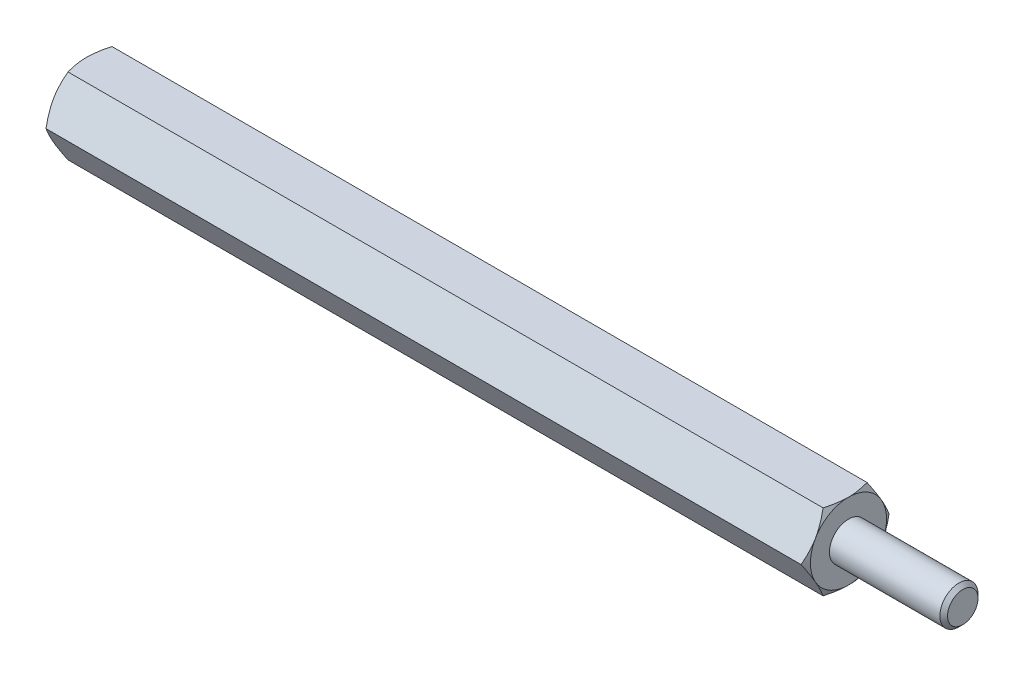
ISO-10303-21;
HEADER;
FILE_DESCRIPTION(('STEP AP214'),'2;1');
FILE_NAME('part.step','',(''),(''),'','','');
FILE_SCHEMA(('AUTOMOTIVE_DESIGN { 1 0 10303 214 1 1 1 1 }'));
ENDSEC;
DATA;
#1=APPLICATION_CONTEXT('core data for automotive mechanical design processes');
#2=APPLICATION_PROTOCOL_DEFINITION('international standard','automotive_design',2000,#1);
#3=PRODUCT_CONTEXT('',#1,'mechanical');
#4=PRODUCT('Part','Part','',(#3));
#5=PRODUCT_RELATED_PRODUCT_CATEGORY('part','',(#4));
#6=PRODUCT_DEFINITION_FORMATION('','',#4);
#7=PRODUCT_DEFINITION_CONTEXT('part definition',#1,'design');
#8=PRODUCT_DEFINITION('design','',#6,#7);
#9=PRODUCT_DEFINITION_SHAPE('','',#8);
#10=(LENGTH_UNIT() NAMED_UNIT(*) SI_UNIT(.MILLI.,.METRE.));
#11=(NAMED_UNIT(*) PLANE_ANGLE_UNIT() SI_UNIT($,.RADIAN.));
#12=(NAMED_UNIT(*) SI_UNIT($,.STERADIAN.) SOLID_ANGLE_UNIT());
#13=UNCERTAINTY_MEASURE_WITH_UNIT(LENGTH_MEASURE(1.E-05),#10,'distance_accuracy_value','');
#14=(GEOMETRIC_REPRESENTATION_CONTEXT(3) GLOBAL_UNCERTAINTY_ASSIGNED_CONTEXT((#13)) GLOBAL_UNIT_ASSIGNED_CONTEXT((#10,
#11,#12)) REPRESENTATION_CONTEXT('',''));
#15=CARTESIAN_POINT('',(0.,0.,0.));
#16=DIRECTION('',(0.,0.,1.));
#17=DIRECTION('',(1.,0.,0.));
#18=AXIS2_PLACEMENT_3D('',#15,#16,#17);
#19=CARTESIAN_POINT('',(20.,2.,-1.15470053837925));
#20=DIRECTION('',(1.,0.,0.));
#21=DIRECTION('',(0.,0.,-1.));
#22=AXIS2_PLACEMENT_3D('',#19,#20,#21);
#23=PLANE('',#22);
#24=CARTESIAN_POINT('',(20.,0.,0.));
#25=DIRECTION('',(1.,0.,0.));
#26=DIRECTION('',(0.,0.,-1.));
#27=AXIS2_PLACEMENT_3D('',#24,#25,#26);
#28=CIRCLE('',#27,2.);
#29=CARTESIAN_POINT('',(20.,-1.,-1.73205080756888));
#30=VERTEX_POINT('',#29);
#31=CARTESIAN_POINT('',(20.,0.999999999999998,-1.73205080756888));
#32=VERTEX_POINT('',#31);
#33=EDGE_CURVE('E288',#30,#32,#28,.T.);
#34=ORIENTED_EDGE('',*,*,#33,.T.);
#35=CARTESIAN_POINT('',(20.,2.,0.));
#36=VERTEX_POINT('',#35);
#37=EDGE_CURVE('E53',#32,#36,#28,.T.);
#38=ORIENTED_EDGE('',*,*,#37,.T.);
#39=CARTESIAN_POINT('',(20.,0.999999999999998,1.73205080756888));
#40=VERTEX_POINT('',#39);
#41=EDGE_CURVE('E296',#36,#40,#28,.T.);
#42=ORIENTED_EDGE('',*,*,#41,.T.);
#43=CARTESIAN_POINT('',(20.,-1.00000000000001,1.73205080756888));
#44=VERTEX_POINT('',#43);
#45=EDGE_CURVE('E301',#40,#44,#28,.T.);
#46=ORIENTED_EDGE('',*,*,#45,.T.);
#47=CARTESIAN_POINT('',(20.,0.,0.));
#48=DIRECTION('',(-1.,0.,0.));
#49=DIRECTION('',(0.,-1.,0.));
#50=AXIS2_PLACEMENT_3D('',#47,#48,#49);
#51=CIRCLE('',#50,2.);
#52=CARTESIAN_POINT('',(20.,-2.00000000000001,0.));
#53=VERTEX_POINT('',#52);
#54=EDGE_CURVE('E193',#53,#44,#51,.T.);
#55=ORIENTED_EDGE('',*,*,#54,.F.);
#56=EDGE_CURVE('E61',#53,#30,#28,.T.);
#57=ORIENTED_EDGE('',*,*,#56,.T.);
#58=EDGE_LOOP('',(#34,#38,#42,#46,#55,#57));
#59=FACE_BOUND('',#58,.T.);
#60=CARTESIAN_POINT('',(20.,0.,0.));
#61=DIRECTION('',(1.,0.,0.));
#62=DIRECTION('',(0.,0.,-1.));
#63=AXIS2_PLACEMENT_3D('',#60,#61,#62);
#64=CIRCLE('',#63,1.);
#65=CARTESIAN_POINT('',(20.,0.,-1.));
#66=VERTEX_POINT('',#65);
#67=EDGE_CURVE('E411',#66,#66,#64,.T.);
#68=ORIENTED_EDGE('',*,*,#67,.F.);
#69=EDGE_LOOP('',(#68));
#70=FACE_BOUND('',#69,.T.);
#71=ADVANCED_FACE('F37',(#59,#70),#23,.T.);
#72=CARTESIAN_POINT('',(20.,0.,-2.3094010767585));
#73=DIRECTION('',(0.,-0.5,0.866025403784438));
#74=DIRECTION('',(0.,-0.866025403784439,-0.5));
#75=AXIS2_PLACEMENT_3D('',#72,#73,#74);
#76=PLANE('',#75);
#77=CARTESIAN_POINT('',(19.8213005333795,-0.000199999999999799,-2.30951654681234));
#78=CARTESIAN_POINT('',(19.8506104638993,0.0876912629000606,-2.25877250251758));
#79=CARTESIAN_POINT('',(19.8772671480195,0.176341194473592,-2.20759044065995));
#80=CARTESIAN_POINT('',(19.9237975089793,0.355176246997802,-2.10433997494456));
#81=CARTESIAN_POINT('',(19.9436547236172,0.445364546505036,-2.05226973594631));
#82=CARTESIAN_POINT('',(19.9745665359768,0.624623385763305,-1.94877459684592));
#83=CARTESIAN_POINT('',(19.9858268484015,0.713666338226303,-1.89736562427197));
#84=CARTESIAN_POINT('',(19.9992713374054,0.892171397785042,-1.79430568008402));
#85=CARTESIAN_POINT('',(20.0014666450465,0.981632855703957,-1.74265508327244));
#86=CARTESIAN_POINT('',(19.9969090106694,1.1488083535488,-1.64613626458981));
#87=CARTESIAN_POINT('',(19.991275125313,1.22654737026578,-1.60125362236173));
#88=CARTESIAN_POINT('',(19.9734161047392,1.38151891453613,-1.51178075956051));
#89=CARTESIAN_POINT('',(19.9611848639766,1.4587509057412,-1.46719084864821));
#90=CARTESIAN_POINT('',(19.9306065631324,1.6140421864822,-1.37753338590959));
#91=CARTESIAN_POINT('',(19.9121298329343,1.69208181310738,-1.33247718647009));
#92=CARTESIAN_POINT('',(19.8701944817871,1.84699686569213,-1.24303693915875));
#93=CARTESIAN_POINT('',(19.8467457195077,1.92387427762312,-1.1986517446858));
#94=CARTESIAN_POINT('',(19.8213005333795,2.0002,-1.15458506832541));
#95=B_SPLINE_CURVE_WITH_KNOTS('',3,(#77,#78,#79,#80,#81,#82,#83,#84,#85,#86,#87,#88,#89,#90,#91,
#92,#93,#94),.UNSPECIFIED.,.F.,.F.,(4,2,2,2,2,2,2,2,4),(0.,0.317031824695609,0.634825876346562,
0.944753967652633,1.25430138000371,1.52387047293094,1.79368946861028,2.06949491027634,
2.34475850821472),.UNSPECIFIED.);
#96=CARTESIAN_POINT('',(19.8213672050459,0.,-2.3094010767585));
#97=VERTEX_POINT('',#96);
#98=EDGE_CURVE('E360',#97,#32,#95,.T.);
#99=ORIENTED_EDGE('',*,*,#98,.F.);
#100=DIRECTION('',(-1.,0.,0.));
#101=VECTOR('',#100,1.);
#102=CARTESIAN_POINT('',(20.,0.,-2.3094010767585));
#103=LINE('',#102,#101);
#104=CARTESIAN_POINT('',(-19.8213672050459,0.,-2.3094010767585));
#105=VERTEX_POINT('',#104);
#106=EDGE_CURVE('E264',#97,#105,#103,.T.);
#107=ORIENTED_EDGE('',*,*,#106,.T.);
#108=CARTESIAN_POINT('',(-19.8213005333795,2.0002,-1.15458506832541));
#109=CARTESIAN_POINT('',(-19.8506104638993,1.91230873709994,-1.20532911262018));
#110=CARTESIAN_POINT('',(-19.8772671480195,1.82365880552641,-1.2565111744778));
#111=CARTESIAN_POINT('',(-19.9237975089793,1.6448237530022,-1.35976164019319));
#112=CARTESIAN_POINT('',(-19.9436547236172,1.55463545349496,-1.41183187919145));
#113=CARTESIAN_POINT('',(-19.9745665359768,1.37537661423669,-1.51532701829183));
#114=CARTESIAN_POINT('',(-19.9858268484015,1.2863336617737,-1.56673599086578));
#115=CARTESIAN_POINT('',(-19.9992713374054,1.10782860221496,-1.66979593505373));
#116=CARTESIAN_POINT('',(-20.0014666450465,1.01836714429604,-1.72144653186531));
#117=CARTESIAN_POINT('',(-19.9969090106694,0.851191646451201,-1.81796535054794));
#118=CARTESIAN_POINT('',(-19.991275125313,0.773452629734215,-1.86284799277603));
#119=CARTESIAN_POINT('',(-19.9734161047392,0.618481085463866,-1.95232085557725));
#120=CARTESIAN_POINT('',(-19.9611848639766,0.541249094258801,-1.99691076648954));
#121=CARTESIAN_POINT('',(-19.9306065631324,0.385957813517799,-2.08656822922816));
#122=CARTESIAN_POINT('',(-19.9121298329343,0.30791818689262,-2.13162442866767));
#123=CARTESIAN_POINT('',(-19.8701944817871,0.153003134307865,-2.221064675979));
#124=CARTESIAN_POINT('',(-19.8467457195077,0.0761257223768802,-2.26544987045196));
#125=CARTESIAN_POINT('',(-19.8213005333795,-0.000199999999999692,-2.30951654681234));
#126=B_SPLINE_CURVE_WITH_KNOTS('',3,(#108,#109,#110,#111,#112,#113,#114,#115,#116,#117,#118,
#119,#120,#121,#122,#123,#124,#125),.UNSPECIFIED.,.F.,.F.,(4,2,2,2,2,2,2,2,4),(0.,
0.31703182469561,0.634825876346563,0.944753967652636,1.25430138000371,1.52387047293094,
1.79368946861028,2.06949491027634,2.34475850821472),.UNSPECIFIED.);
#127=CARTESIAN_POINT('',(-20.,0.999999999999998,-1.73205080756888));
#128=VERTEX_POINT('',#127);
#129=EDGE_CURVE('E328',#128,#105,#126,.T.);
#130=ORIENTED_EDGE('',*,*,#129,.F.);
#131=CARTESIAN_POINT('',(-19.8213672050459,2.,-1.15470053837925));
#132=VERTEX_POINT('',#131);
#133=EDGE_CURVE('E325',#132,#128,#126,.T.);
#134=ORIENTED_EDGE('',*,*,#133,.F.);
#135=DIRECTION('',(-1.,0.,0.));
#136=VECTOR('',#135,1.);
#137=CARTESIAN_POINT('',(20.,2.,-1.15470053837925));
#138=LINE('',#137,#136);
#139=CARTESIAN_POINT('',(19.821367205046,2.,-1.15470053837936));
#140=VERTEX_POINT('',#139);
#141=EDGE_CURVE('E279',#140,#132,#138,.T.);
#142=ORIENTED_EDGE('',*,*,#141,.F.);
#143=EDGE_CURVE('E229',#32,#140,#95,.T.);
#144=ORIENTED_EDGE('',*,*,#143,.F.);
#145=EDGE_LOOP('',(#99,#107,#130,#134,#142,#144));
#146=FACE_BOUND('',#145,.T.);
#147=ADVANCED_FACE('F148',(#146),#76,.F.);
#148=CARTESIAN_POINT('',(20.,2.,-1.15470053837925));
#149=DIRECTION('',(0.,-1.,0.));
#150=DIRECTION('',(0.,0.,-1.));
#151=AXIS2_PLACEMENT_3D('',#148,#149,#150);
#152=PLANE('',#151);
#153=CARTESIAN_POINT('',(19.0041453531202,2.,-3.14239762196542));
#154=CARTESIAN_POINT('',(19.0468568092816,2.,-3.05468337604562));
#155=CARTESIAN_POINT('',(19.0891703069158,2.,-2.96677207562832));
#156=CARTESIAN_POINT('',(19.1727783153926,2.,-2.79045070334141));
#157=CARTESIAN_POINT('',(19.2140726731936,2.,-2.70204055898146));
#158=CARTESIAN_POINT('',(19.2956183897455,2.,-2.52418069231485));
#159=CARTESIAN_POINT('',(19.3358631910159,2.,-2.43472795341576));
#160=CARTESIAN_POINT('',(19.4147590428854,2.,-2.25512498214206));
#161=CARTESIAN_POINT('',(19.4534101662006,2.,-2.16497478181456));
#162=CARTESIAN_POINT('',(19.5299661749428,2.,-1.98078525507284));
#163=CARTESIAN_POINT('',(19.5678021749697,2.,-1.88671714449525));
#164=CARTESIAN_POINT('',(19.6407004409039,2.,-1.69751412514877));
#165=CARTESIAN_POINT('',(19.6757629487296,2.,-1.60237931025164));
#166=CARTESIAN_POINT('',(19.7422353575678,2.,-1.41102905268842));
#167=CARTESIAN_POINT('',(19.7736519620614,2.,-1.31481596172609));
#168=CARTESIAN_POINT('',(19.8318476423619,2.,-1.12101028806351));
#169=CARTESIAN_POINT('',(19.8586281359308,2.,-1.02341813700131));
#170=CARTESIAN_POINT('',(19.9061516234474,2.,-0.827336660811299));
#171=CARTESIAN_POINT('',(19.9269281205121,2.,-0.728855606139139));
#172=CARTESIAN_POINT('',(19.9612955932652,2.,-0.530628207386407));
#173=CARTESIAN_POINT('',(19.9748873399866,2.,-0.430882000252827));
#174=CARTESIAN_POINT('',(19.9936215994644,2.,-0.231937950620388));
#175=CARTESIAN_POINT('',(19.998875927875,2.,-0.132750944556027));
#176=CARTESIAN_POINT('',(20.0007996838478,2.,0.0657049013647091));
#177=CARTESIAN_POINT('',(19.9974689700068,2.,0.164973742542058));
#178=CARTESIAN_POINT('',(19.9796512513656,2.,0.400692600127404));
#179=CARTESIAN_POINT('',(19.9613884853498,2.,0.536859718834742));
#180=CARTESIAN_POINT('',(19.9117995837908,2.,0.80679264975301));
#181=CARTESIAN_POINT('',(19.8804615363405,2.,0.940556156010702));
#182=CARTESIAN_POINT('',(19.8073369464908,2.,1.20849227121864));
#183=CARTESIAN_POINT('',(19.7653231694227,2.,1.34260127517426));
#184=CARTESIAN_POINT('',(19.6970115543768,2.,1.54188460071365));
#185=CARTESIAN_POINT('',(19.6733612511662,2.,1.6079939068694));
#186=CARTESIAN_POINT('',(19.6245731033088,2.,1.73966131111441));
#187=CARTESIAN_POINT('',(19.5994352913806,2.,1.80521942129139));
#188=CARTESIAN_POINT('',(19.530452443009,2.,1.98014362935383));
#189=CARTESIAN_POINT('',(19.4854828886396,2.,2.08906517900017));
#190=CARTESIAN_POINT('',(19.3929395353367,2.,2.3058004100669));
#191=CARTESIAN_POINT('',(19.345365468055,2.,2.41361397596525));
#192=CARTESIAN_POINT('',(19.2482262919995,2.,2.62838132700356));
#193=CARTESIAN_POINT('',(19.1986605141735,2.,2.73533480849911));
#194=CARTESIAN_POINT('',(19.0980014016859,2.,2.94852186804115));
#195=CARTESIAN_POINT('',(19.046908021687,2.,3.05475542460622));
#196=CARTESIAN_POINT('',(18.8916961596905,2.,3.37291303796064));
#197=CARTESIAN_POINT('',(18.7857965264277,2.,3.58396705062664));
#198=CARTESIAN_POINT('',(18.5710098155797,2.,4.00448363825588));
#199=CARTESIAN_POINT('',(18.4621233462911,2.,4.21394652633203));
#200=CARTESIAN_POINT('',(18.2537677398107,2.,4.61000648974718));
#201=CARTESIAN_POINT('',(18.1545007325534,2.,4.79671008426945));
#202=CARTESIAN_POINT('',(17.9547641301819,2.,5.16948614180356));
#203=CARTESIAN_POINT('',(17.8542944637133,2.,5.35555856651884));
#204=CARTESIAN_POINT('',(17.6527937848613,2.,5.72660635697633));
#205=CARTESIAN_POINT('',(17.5517657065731,2.,5.91158331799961));
#206=CARTESIAN_POINT('',(17.3490239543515,2.,6.28114276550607));
#207=CARTESIAN_POINT('',(17.2473103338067,2.,6.46572528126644));
#208=CARTESIAN_POINT('',(17.1453470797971,2.,6.65016883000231));
#209=B_SPLINE_CURVE_WITH_KNOTS('',3,(#153,#154,#155,#156,#157,#158,#159,#160,#161,#162,#163,
#164,#165,#166,#167,#168,#169,#170,#171,#172,#173,#174,#175,#176,#177,#178,#179,#180,#181,#182,
#183,#184,#185,#186,#187,#188,#189,#190,#191,#192,#193,#194,#195,#196,#197,#198,#199,#200,#201,
#202,#203,#204,#205,#206,#207,#208),.UNSPECIFIED.,.F.,.F.,(4,2,2,2,2,2,2,2,2,2,2,2,2,2,2,2,2,2,
2,2,2,2,2,2,2,2,2,4),(0.,0.292684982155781,0.585413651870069,0.879667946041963,1.17390879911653,
1.47805164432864,1.78216793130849,2.08571589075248,2.38917085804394,2.690898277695,
2.99259331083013,3.29020694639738,3.58782548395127,3.99913738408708,4.41082482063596,
4.83214112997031,5.04276628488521,5.25338680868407,5.60685637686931,5.96036243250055,
6.31398824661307,6.66762456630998,7.37597688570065,8.0841859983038,8.71853756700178,
9.35292696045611,9.98522933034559,10.6174830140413),.UNSPECIFIED.);
#210=EDGE_CURVE('E227',#140,#36,#209,.T.);
#211=ORIENTED_EDGE('',*,*,#210,.F.);
#212=ORIENTED_EDGE('',*,*,#141,.T.);
#213=CARTESIAN_POINT('',(-19.0041453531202,2.,-3.14239762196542));
#214=CARTESIAN_POINT('',(-19.0468568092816,2.,-3.05468337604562));
#215=CARTESIAN_POINT('',(-19.0891703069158,2.,-2.96677207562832));
#216=CARTESIAN_POINT('',(-19.1727783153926,2.,-2.79045070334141));
#217=CARTESIAN_POINT('',(-19.2140726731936,2.,-2.70204055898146));
#218=CARTESIAN_POINT('',(-19.2956183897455,2.,-2.52418069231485));
#219=CARTESIAN_POINT('',(-19.3358631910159,2.,-2.43472795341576));
#220=CARTESIAN_POINT('',(-19.4147590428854,2.,-2.25512498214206));
#221=CARTESIAN_POINT('',(-19.4534101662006,2.,-2.16497478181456));
#222=CARTESIAN_POINT('',(-19.5299661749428,2.,-1.98078525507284));
#223=CARTESIAN_POINT('',(-19.5678021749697,2.,-1.88671714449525));
#224=CARTESIAN_POINT('',(-19.6407004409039,2.,-1.69751412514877));
#225=CARTESIAN_POINT('',(-19.6757629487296,2.,-1.60237931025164));
#226=CARTESIAN_POINT('',(-19.7422353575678,2.,-1.41102905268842));
#227=CARTESIAN_POINT('',(-19.7736519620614,2.,-1.31481596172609));
#228=CARTESIAN_POINT('',(-19.8318476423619,2.,-1.12101028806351));
#229=CARTESIAN_POINT('',(-19.8586281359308,2.,-1.02341813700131));
#230=CARTESIAN_POINT('',(-19.9061516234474,2.,-0.827336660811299));
#231=CARTESIAN_POINT('',(-19.9269281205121,2.,-0.728855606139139));
#232=CARTESIAN_POINT('',(-19.9612955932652,2.,-0.530628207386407));
#233=CARTESIAN_POINT('',(-19.9748873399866,2.,-0.430882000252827));
#234=CARTESIAN_POINT('',(-19.9936215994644,2.,-0.231937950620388));
#235=CARTESIAN_POINT('',(-19.998875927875,2.,-0.132750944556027));
#236=CARTESIAN_POINT('',(-20.0007996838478,2.,0.0657049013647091));
#237=CARTESIAN_POINT('',(-19.9974689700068,2.,0.164973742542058));
#238=CARTESIAN_POINT('',(-19.9796512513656,2.,0.400692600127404));
#239=CARTESIAN_POINT('',(-19.9613884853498,2.,0.536859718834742));
#240=CARTESIAN_POINT('',(-19.9117995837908,2.,0.80679264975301));
#241=CARTESIAN_POINT('',(-19.8804615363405,2.,0.940556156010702));
#242=CARTESIAN_POINT('',(-19.8073369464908,2.,1.20849227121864));
#243=CARTESIAN_POINT('',(-19.7653231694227,2.,1.34260127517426));
#244=CARTESIAN_POINT('',(-19.6970115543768,2.,1.54188460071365));
#245=CARTESIAN_POINT('',(-19.6733612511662,2.,1.6079939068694));
#246=CARTESIAN_POINT('',(-19.6245731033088,2.,1.73966131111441));
#247=CARTESIAN_POINT('',(-19.5994352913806,2.,1.80521942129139));
#248=CARTESIAN_POINT('',(-19.530452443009,2.,1.98014362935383));
#249=CARTESIAN_POINT('',(-19.4854828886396,2.,2.08906517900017));
#250=CARTESIAN_POINT('',(-19.3929395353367,2.,2.3058004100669));
#251=CARTESIAN_POINT('',(-19.345365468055,2.,2.41361397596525));
#252=CARTESIAN_POINT('',(-19.2482262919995,2.,2.62838132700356));
#253=CARTESIAN_POINT('',(-19.1986605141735,2.,2.73533480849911));
#254=CARTESIAN_POINT('',(-19.0980014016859,2.,2.94852186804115));
#255=CARTESIAN_POINT('',(-19.046908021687,2.,3.05475542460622));
#256=CARTESIAN_POINT('',(-18.8916961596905,2.,3.37291303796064));
#257=CARTESIAN_POINT('',(-18.7857965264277,2.,3.58396705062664));
#258=CARTESIAN_POINT('',(-18.5710098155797,2.,4.00448363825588));
#259=CARTESIAN_POINT('',(-18.4621233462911,2.,4.21394652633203));
#260=CARTESIAN_POINT('',(-18.2537677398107,2.,4.61000648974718));
#261=CARTESIAN_POINT('',(-18.1545007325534,2.,4.79671008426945));
#262=CARTESIAN_POINT('',(-17.9547641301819,2.,5.16948614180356));
#263=CARTESIAN_POINT('',(-17.8542944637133,2.,5.35555856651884));
#264=CARTESIAN_POINT('',(-17.6527937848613,2.,5.72660635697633));
#265=CARTESIAN_POINT('',(-17.5517657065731,2.,5.91158331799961));
#266=CARTESIAN_POINT('',(-17.3490239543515,2.,6.28114276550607));
#267=CARTESIAN_POINT('',(-17.2473103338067,2.,6.46572528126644));
#268=CARTESIAN_POINT('',(-17.1453470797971,2.,6.65016883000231));
#269=B_SPLINE_CURVE_WITH_KNOTS('',3,(#213,#214,#215,#216,#217,#218,#219,#220,#221,#222,#223,
#224,#225,#226,#227,#228,#229,#230,#231,#232,#233,#234,#235,#236,#237,#238,#239,#240,#241,#242,
#243,#244,#245,#246,#247,#248,#249,#250,#251,#252,#253,#254,#255,#256,#257,#258,#259,#260,#261,
#262,#263,#264,#265,#266,#267,#268),.UNSPECIFIED.,.F.,.F.,(4,2,2,2,2,2,2,2,2,2,2,2,2,2,2,2,2,2,
2,2,2,2,2,2,2,2,2,4),(0.,0.292684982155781,0.585413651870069,0.879667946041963,1.17390879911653,
1.47805164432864,1.78216793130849,2.08571589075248,2.38917085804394,2.690898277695,
2.99259331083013,3.29020694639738,3.58782548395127,3.99913738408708,4.41082482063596,
4.83214112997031,5.04276628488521,5.25338680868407,5.60685637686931,5.96036243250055,
6.31398824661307,6.66762456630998,7.37597688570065,8.0841859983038,8.71853756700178,
9.35292696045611,9.98522933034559,10.6174830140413),.UNSPECIFIED.);
#270=CARTESIAN_POINT('',(-20.,2.,0.));
#271=VERTEX_POINT('',#270);
#272=EDGE_CURVE('E241',#271,#132,#269,.F.);
#273=ORIENTED_EDGE('',*,*,#272,.F.);
#274=CARTESIAN_POINT('',(-19.8213672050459,2.,1.15470053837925));
#275=VERTEX_POINT('',#274);
#276=EDGE_CURVE('E249',#275,#271,#269,.F.);
#277=ORIENTED_EDGE('',*,*,#276,.F.);
#278=DIRECTION('',(-1.,0.,0.));
#279=VECTOR('',#278,1.);
#280=CARTESIAN_POINT('',(20.,2.,1.15470053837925));
#281=LINE('',#280,#279);
#282=CARTESIAN_POINT('',(19.8213672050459,2.,1.15470053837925));
#283=VERTEX_POINT('',#282);
#284=EDGE_CURVE('E276',#283,#275,#281,.T.);
#285=ORIENTED_EDGE('',*,*,#284,.F.);
#286=EDGE_CURVE('E221',#36,#283,#209,.T.);
#287=ORIENTED_EDGE('',*,*,#286,.F.);
#288=EDGE_LOOP('',(#211,#212,#273,#277,#285,#287));
#289=FACE_BOUND('',#288,.T.);
#290=ADVANCED_FACE('F153',(#289),#152,.F.);
#291=CARTESIAN_POINT('',(20.,2.,1.15470053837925));
#292=DIRECTION('',(0.,-0.5,-0.866025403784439));
#293=DIRECTION('',(0.,0.866025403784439,-0.5));
#294=AXIS2_PLACEMENT_3D('',#291,#292,#293);
#295=PLANE('',#294);
#296=CARTESIAN_POINT('',(19.8213005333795,2.0002,1.15458506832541));
#297=CARTESIAN_POINT('',(19.8506104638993,1.91230873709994,1.20532911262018));
#298=CARTESIAN_POINT('',(19.8772671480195,1.82365880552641,1.2565111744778));
#299=CARTESIAN_POINT('',(19.9237975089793,1.6448237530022,1.35976164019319));
#300=CARTESIAN_POINT('',(19.9436547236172,1.55463545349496,1.41183187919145));
#301=CARTESIAN_POINT('',(19.9745665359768,1.37537661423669,1.51532701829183));
#302=CARTESIAN_POINT('',(19.9858268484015,1.2863336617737,1.56673599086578));
#303=CARTESIAN_POINT('',(19.9992713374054,1.10782860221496,1.66979593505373));
#304=CARTESIAN_POINT('',(20.0014666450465,1.01836714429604,1.72144653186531));
#305=CARTESIAN_POINT('',(19.9969090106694,0.851191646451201,1.81796535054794));
#306=CARTESIAN_POINT('',(19.991275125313,0.773452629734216,1.86284799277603));
#307=CARTESIAN_POINT('',(19.9734161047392,0.618481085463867,1.95232085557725));
#308=CARTESIAN_POINT('',(19.9611848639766,0.541249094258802,1.99691076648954));
#309=CARTESIAN_POINT('',(19.9306065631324,0.3859578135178,2.08656822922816));
#310=CARTESIAN_POINT('',(19.9121298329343,0.307918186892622,2.13162442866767));
#311=CARTESIAN_POINT('',(19.8701944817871,0.153003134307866,2.221064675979));
#312=CARTESIAN_POINT('',(19.8467457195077,0.0761257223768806,2.26544987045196));
#313=CARTESIAN_POINT('',(19.8213005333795,-0.000199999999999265,2.30951654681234));
#314=B_SPLINE_CURVE_WITH_KNOTS('',3,(#296,#297,#298,#299,#300,#301,#302,#303,#304,#305,#306,
#307,#308,#309,#310,#311,#312,#313),.UNSPECIFIED.,.F.,.F.,(4,2,2,2,2,2,2,2,4),(0.,
0.31703182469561,0.634825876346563,0.944753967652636,1.25430138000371,1.52387047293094,
1.79368946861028,2.06949491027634,2.34475850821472),.UNSPECIFIED.);
#315=EDGE_CURVE('E228',#283,#40,#314,.T.);
#316=ORIENTED_EDGE('',*,*,#315,.F.);
#317=ORIENTED_EDGE('',*,*,#284,.T.);
#318=CARTESIAN_POINT('',(-19.8213005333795,-0.000199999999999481,2.30951654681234));
#319=CARTESIAN_POINT('',(-19.8506104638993,0.0876912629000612,2.25877250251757));
#320=CARTESIAN_POINT('',(-19.8772671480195,0.176341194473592,2.20759044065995));
#321=CARTESIAN_POINT('',(-19.9237975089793,0.355176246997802,2.10433997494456));
#322=CARTESIAN_POINT('',(-19.9436547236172,0.445364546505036,2.0522697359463));
#323=CARTESIAN_POINT('',(-19.9745665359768,0.624623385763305,1.94877459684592));
#324=CARTESIAN_POINT('',(-19.9858268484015,0.713666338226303,1.89736562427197));
#325=CARTESIAN_POINT('',(-19.9992713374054,0.892171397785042,1.79430568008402));
#326=CARTESIAN_POINT('',(-20.0014666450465,0.981632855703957,1.74265508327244));
#327=CARTESIAN_POINT('',(-19.9969090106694,1.1488083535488,1.64613626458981));
#328=CARTESIAN_POINT('',(-19.991275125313,1.22654737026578,1.60125362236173));
#329=CARTESIAN_POINT('',(-19.9734161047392,1.38151891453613,1.51178075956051));
#330=CARTESIAN_POINT('',(-19.9611848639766,1.4587509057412,1.46719084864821));
#331=CARTESIAN_POINT('',(-19.9306065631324,1.6140421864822,1.37753338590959));
#332=CARTESIAN_POINT('',(-19.9121298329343,1.69208181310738,1.33247718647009));
#333=CARTESIAN_POINT('',(-19.8701944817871,1.84699686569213,1.24303693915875));
#334=CARTESIAN_POINT('',(-19.8467457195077,1.92387427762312,1.1986517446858));
#335=CARTESIAN_POINT('',(-19.8213005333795,2.0002,1.15458506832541));
#336=B_SPLINE_CURVE_WITH_KNOTS('',3,(#318,#319,#320,#321,#322,#323,#324,#325,#326,#327,#328,
#329,#330,#331,#332,#333,#334,#335),.UNSPECIFIED.,.F.,.F.,(4,2,2,2,2,2,2,2,4),(0.,
0.31703182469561,0.634825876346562,0.944753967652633,1.25430138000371,1.52387047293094,
1.79368946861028,2.06949491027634,2.34475850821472),.UNSPECIFIED.);
#337=CARTESIAN_POINT('',(-20.,0.999999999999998,1.73205080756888));
#338=VERTEX_POINT('',#337);
#339=EDGE_CURVE('E255',#338,#275,#336,.T.);
#340=ORIENTED_EDGE('',*,*,#339,.F.);
#341=CARTESIAN_POINT('',(-19.8213672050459,0.,2.3094010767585));
#342=VERTEX_POINT('',#341);
#343=EDGE_CURVE('E262',#342,#338,#336,.T.);
#344=ORIENTED_EDGE('',*,*,#343,.F.);
#345=DIRECTION('',(-1.,0.,0.));
#346=VECTOR('',#345,1.);
#347=CARTESIAN_POINT('',(20.,0.,2.3094010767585));
#348=LINE('',#347,#346);
#349=CARTESIAN_POINT('',(19.8213672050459,0.,2.3094010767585));
#350=VERTEX_POINT('',#349);
#351=EDGE_CURVE('E273',#350,#342,#348,.T.);
#352=ORIENTED_EDGE('',*,*,#351,.F.);
#353=EDGE_CURVE('E215',#40,#350,#314,.T.);
#354=ORIENTED_EDGE('',*,*,#353,.F.);
#355=EDGE_LOOP('',(#316,#317,#340,#344,#352,#354));
#356=FACE_BOUND('',#355,.T.);
#357=ADVANCED_FACE('F235',(#356),#295,.F.);
#358=CARTESIAN_POINT('',(20.,0.,2.3094010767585));
#359=DIRECTION('',(0.,0.5,-0.866025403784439));
#360=DIRECTION('',(0.,0.866025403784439,0.5));
#361=AXIS2_PLACEMENT_3D('',#358,#359,#360);
#362=PLANE('',#361);
#363=CARTESIAN_POINT('',(19.8213005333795,0.000200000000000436,2.30951654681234));
#364=CARTESIAN_POINT('',(19.8506104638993,-0.0876912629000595,2.25877250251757));
#365=CARTESIAN_POINT('',(19.8772671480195,-0.176341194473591,2.20759044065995));
#366=CARTESIAN_POINT('',(19.9237975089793,-0.355176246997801,2.10433997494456));
#367=CARTESIAN_POINT('',(19.9436547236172,-0.445364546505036,2.0522697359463));
#368=CARTESIAN_POINT('',(19.9745665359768,-0.624623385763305,1.94877459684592));
#369=CARTESIAN_POINT('',(19.9858268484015,-0.713666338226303,1.89736562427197));
#370=CARTESIAN_POINT('',(19.9992713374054,-0.892171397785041,1.79430568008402));
#371=CARTESIAN_POINT('',(20.0014666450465,-0.981632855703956,1.74265508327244));
#372=CARTESIAN_POINT('',(19.9969090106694,-1.1488083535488,1.64613626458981));
#373=CARTESIAN_POINT('',(19.991275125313,-1.22654737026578,1.60125362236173));
#374=CARTESIAN_POINT('',(19.9734161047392,-1.38151891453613,1.51178075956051));
#375=CARTESIAN_POINT('',(19.9611848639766,-1.4587509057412,1.46719084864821));
#376=CARTESIAN_POINT('',(19.9306065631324,-1.6140421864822,1.37753338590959));
#377=CARTESIAN_POINT('',(19.9121298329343,-1.69208181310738,1.33247718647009));
#378=CARTESIAN_POINT('',(19.8701944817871,-1.84699686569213,1.24303693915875));
#379=CARTESIAN_POINT('',(19.8467457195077,-1.92387427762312,1.1986517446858));
#380=CARTESIAN_POINT('',(19.8213005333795,-2.0002,1.15458506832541));
#381=B_SPLINE_CURVE_WITH_KNOTS('',3,(#363,#364,#365,#366,#367,#368,#369,#370,#371,#372,#373,
#374,#375,#376,#377,#378,#379,#380),.UNSPECIFIED.,.F.,.F.,(4,2,2,2,2,2,2,2,4),(0.,
0.317031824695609,0.634825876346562,0.944753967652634,1.25430138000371,1.52387047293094,
1.79368946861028,2.06949491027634,2.34475850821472),.UNSPECIFIED.);
#382=EDGE_CURVE('E389',#350,#44,#381,.T.);
#383=ORIENTED_EDGE('',*,*,#382,.F.);
#384=ORIENTED_EDGE('',*,*,#351,.T.);
#385=CARTESIAN_POINT('',(-19.8213005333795,-2.0002,1.15458506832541));
#386=CARTESIAN_POINT('',(-19.8506104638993,-1.91230873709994,1.20532911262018));
#387=CARTESIAN_POINT('',(-19.8772671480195,-1.82365880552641,1.2565111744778));
#388=CARTESIAN_POINT('',(-19.9237975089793,-1.6448237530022,1.35976164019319));
#389=CARTESIAN_POINT('',(-19.9436547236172,-1.55463545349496,1.41183187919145));
#390=CARTESIAN_POINT('',(-19.9745665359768,-1.3753766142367,1.51532701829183));
#391=CARTESIAN_POINT('',(-19.9858268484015,-1.2863336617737,1.56673599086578));
#392=CARTESIAN_POINT('',(-19.9992713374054,-1.10782860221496,1.66979593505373));
#393=CARTESIAN_POINT('',(-20.0014666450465,-1.01836714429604,1.72144653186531));
#394=CARTESIAN_POINT('',(-19.9969090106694,-0.851191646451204,1.81796535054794));
#395=CARTESIAN_POINT('',(-19.991275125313,-0.773452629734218,1.86284799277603));
#396=CARTESIAN_POINT('',(-19.9734161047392,-0.618481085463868,1.95232085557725));
#397=CARTESIAN_POINT('',(-19.9611848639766,-0.541249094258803,1.99691076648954));
#398=CARTESIAN_POINT('',(-19.9306065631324,-0.3859578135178,2.08656822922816));
#399=CARTESIAN_POINT('',(-19.9121298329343,-0.307918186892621,2.13162442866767));
#400=CARTESIAN_POINT('',(-19.8701944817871,-0.153003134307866,2.221064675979));
#401=CARTESIAN_POINT('',(-19.8467457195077,-0.07612572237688,2.26544987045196));
#402=CARTESIAN_POINT('',(-19.8213005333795,0.000200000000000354,2.30951654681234));
#403=B_SPLINE_CURVE_WITH_KNOTS('',3,(#385,#386,#387,#388,#389,#390,#391,#392,#393,#394,#395,
#396,#397,#398,#399,#400,#401,#402),.UNSPECIFIED.,.F.,.F.,(4,2,2,2,2,2,2,2,4),(0.,
0.317031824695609,0.634825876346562,0.944753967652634,1.25430138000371,1.52387047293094,
1.79368946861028,2.06949491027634,2.34475850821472),.UNSPECIFIED.);
#404=CARTESIAN_POINT('',(-20.,-1.00000000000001,1.73205080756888));
#405=VERTEX_POINT('',#404);
#406=EDGE_CURVE('E263',#405,#342,#403,.T.);
#407=ORIENTED_EDGE('',*,*,#406,.F.);
#408=CARTESIAN_POINT('',(-19.8213672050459,-2.,1.15470053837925));
#409=VERTEX_POINT('',#408);
#410=EDGE_CURVE('E250',#409,#405,#403,.T.);
#411=ORIENTED_EDGE('',*,*,#410,.F.);
#412=DIRECTION('',(-1.,0.,0.));
#413=VECTOR('',#412,1.);
#414=CARTESIAN_POINT('',(20.,-2.,1.15470053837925));
#415=LINE('',#414,#413);
#416=CARTESIAN_POINT('',(19.8213672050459,-2.,1.15470053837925));
#417=VERTEX_POINT('',#416);
#418=EDGE_CURVE('E270',#417,#409,#415,.T.);
#419=ORIENTED_EDGE('',*,*,#418,.F.);
#420=EDGE_CURVE('E210',#44,#417,#381,.T.);
#421=ORIENTED_EDGE('',*,*,#420,.F.);
#422=EDGE_LOOP('',(#383,#384,#407,#411,#419,#421));
#423=FACE_BOUND('',#422,.T.);
#424=ADVANCED_FACE('F364',(#423),#362,.F.);
#425=CARTESIAN_POINT('',(20.,-2.,1.15470053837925));
#426=DIRECTION('',(0.,1.,0.));
#427=DIRECTION('',(0.,0.,1.));
#428=AXIS2_PLACEMENT_3D('',#425,#426,#427);
#429=PLANE('',#428);
#430=CARTESIAN_POINT('',(19.0041453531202,-2.,-3.14239762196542));
#431=CARTESIAN_POINT('',(19.0468568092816,-2.,-3.05468337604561));
#432=CARTESIAN_POINT('',(19.0891703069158,-2.,-2.96677207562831));
#433=CARTESIAN_POINT('',(19.1727783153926,-2.,-2.79045070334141));
#434=CARTESIAN_POINT('',(19.2140726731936,-2.,-2.70204055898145));
#435=CARTESIAN_POINT('',(19.2956183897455,-2.,-2.52418069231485));
#436=CARTESIAN_POINT('',(19.3358631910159,-2.,-2.43472795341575));
#437=CARTESIAN_POINT('',(19.4147590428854,-2.,-2.25512498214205));
#438=CARTESIAN_POINT('',(19.4534101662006,-2.,-2.16497478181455));
#439=CARTESIAN_POINT('',(19.5299661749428,-2.,-1.98078525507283));
#440=CARTESIAN_POINT('',(19.5678021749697,-2.,-1.88671714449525));
#441=CARTESIAN_POINT('',(19.6407004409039,-2.,-1.69751412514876));
#442=CARTESIAN_POINT('',(19.6757629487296,-2.,-1.60237931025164));
#443=CARTESIAN_POINT('',(19.7422353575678,-2.,-1.41102905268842));
#444=CARTESIAN_POINT('',(19.7736519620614,-2.,-1.31481596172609));
#445=CARTESIAN_POINT('',(19.8318476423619,-2.,-1.12101028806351));
#446=CARTESIAN_POINT('',(19.8586281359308,-2.,-1.02341813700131));
#447=CARTESIAN_POINT('',(19.9061516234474,-2.,-0.8273366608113));
#448=CARTESIAN_POINT('',(19.9269281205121,-2.,-0.72885560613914));
#449=CARTESIAN_POINT('',(19.9612955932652,-2.,-0.530628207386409));
#450=CARTESIAN_POINT('',(19.9748873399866,-2.,-0.43088200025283));
#451=CARTESIAN_POINT('',(19.9936215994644,-2.,-0.231937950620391));
#452=CARTESIAN_POINT('',(19.998875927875,-2.,-0.132750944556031));
#453=CARTESIAN_POINT('',(20.0007996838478,-2.,0.0657049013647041));
#454=CARTESIAN_POINT('',(19.9974689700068,-2.,0.164973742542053));
#455=CARTESIAN_POINT('',(19.9796512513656,-2.,0.400692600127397));
#456=CARTESIAN_POINT('',(19.9613884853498,-2.,0.536859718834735));
#457=CARTESIAN_POINT('',(19.9117995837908,-2.,0.806792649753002));
#458=CARTESIAN_POINT('',(19.8804615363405,-2.,0.940556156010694));
#459=CARTESIAN_POINT('',(19.8073369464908,-2.,1.20849227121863));
#460=CARTESIAN_POINT('',(19.7653231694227,-2.,1.34260127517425));
#461=CARTESIAN_POINT('',(19.6970115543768,-2.,1.54188460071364));
#462=CARTESIAN_POINT('',(19.6733612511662,-2.,1.60799390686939));
#463=CARTESIAN_POINT('',(19.6245731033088,-2.,1.7396613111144));
#464=CARTESIAN_POINT('',(19.5994352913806,-2.,1.80521942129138));
#465=CARTESIAN_POINT('',(19.530452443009,-2.,1.98014362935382));
#466=CARTESIAN_POINT('',(19.4854828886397,-2.,2.08906517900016));
#467=CARTESIAN_POINT('',(19.3929395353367,-2.,2.30580041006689));
#468=CARTESIAN_POINT('',(19.345365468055,-2.,2.41361397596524));
#469=CARTESIAN_POINT('',(19.2482262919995,-2.,2.62838132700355));
#470=CARTESIAN_POINT('',(19.1986605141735,-2.,2.73533480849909));
#471=CARTESIAN_POINT('',(19.0980014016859,-2.,2.94852186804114));
#472=CARTESIAN_POINT('',(19.046908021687,-2.,3.0547554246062));
#473=CARTESIAN_POINT('',(18.8916961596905,-2.,3.37291303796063));
#474=CARTESIAN_POINT('',(18.7857965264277,-2.,3.58396705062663));
#475=CARTESIAN_POINT('',(18.5710098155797,-2.,4.00448363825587));
#476=CARTESIAN_POINT('',(18.4621233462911,-2.,4.21394652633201));
#477=CARTESIAN_POINT('',(18.2537677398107,-2.,4.61000648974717));
#478=CARTESIAN_POINT('',(18.1545007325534,-2.,4.79671008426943));
#479=CARTESIAN_POINT('',(17.9547641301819,-2.,5.16948614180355));
#480=CARTESIAN_POINT('',(17.8542944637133,-2.,5.35555856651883));
#481=CARTESIAN_POINT('',(17.6527937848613,-2.,5.72660635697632));
#482=CARTESIAN_POINT('',(17.5517657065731,-2.,5.91158331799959));
#483=CARTESIAN_POINT('',(17.3490239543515,-2.,6.28114276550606));
#484=CARTESIAN_POINT('',(17.2473103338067,-2.,6.46572528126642));
#485=CARTESIAN_POINT('',(17.1453470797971,-2.,6.6501688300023));
#486=B_SPLINE_CURVE_WITH_KNOTS('',3,(#430,#431,#432,#433,#434,#435,#436,#437,#438,#439,#440,
#441,#442,#443,#444,#445,#446,#447,#448,#449,#450,#451,#452,#453,#454,#455,#456,#457,#458,#459,
#460,#461,#462,#463,#464,#465,#466,#467,#468,#469,#470,#471,#472,#473,#474,#475,#476,#477,#478,
#479,#480,#481,#482,#483,#484,#485),.UNSPECIFIED.,.F.,.F.,(4,2,2,2,2,2,2,2,2,2,2,2,2,2,2,2,2,2,
2,2,2,2,2,2,2,2,2,4),(0.,0.292684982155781,0.585413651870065,0.879667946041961,1.17390879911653,
1.47805164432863,1.78216793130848,2.08571589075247,2.38917085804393,2.69089827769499,
2.99259331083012,3.29020694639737,3.58782548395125,3.99913738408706,4.41082482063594,
4.83214112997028,5.04276628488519,5.25338680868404,5.60685637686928,5.96036243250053,
6.31398824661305,6.66762456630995,7.37597688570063,8.08418599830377,8.71853756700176,
9.35292696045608,9.98522933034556,10.6174830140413),.UNSPECIFIED.);
#487=EDGE_CURVE('E314',#417,#53,#486,.F.);
#488=ORIENTED_EDGE('',*,*,#487,.F.);
#489=ORIENTED_EDGE('',*,*,#418,.T.);
#490=CARTESIAN_POINT('',(-19.0041453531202,-2.,-3.14239762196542));
#491=CARTESIAN_POINT('',(-19.0468568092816,-2.,-3.05468337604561));
#492=CARTESIAN_POINT('',(-19.0891703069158,-2.,-2.96677207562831));
#493=CARTESIAN_POINT('',(-19.1727783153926,-2.,-2.79045070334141));
#494=CARTESIAN_POINT('',(-19.2140726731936,-2.,-2.70204055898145));
#495=CARTESIAN_POINT('',(-19.2956183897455,-2.,-2.52418069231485));
#496=CARTESIAN_POINT('',(-19.3358631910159,-2.,-2.43472795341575));
#497=CARTESIAN_POINT('',(-19.4147590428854,-2.,-2.25512498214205));
#498=CARTESIAN_POINT('',(-19.4534101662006,-2.,-2.16497478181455));
#499=CARTESIAN_POINT('',(-19.5299661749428,-2.,-1.98078525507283));
#500=CARTESIAN_POINT('',(-19.5678021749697,-2.,-1.88671714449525));
#501=CARTESIAN_POINT('',(-19.6407004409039,-2.,-1.69751412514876));
#502=CARTESIAN_POINT('',(-19.6757629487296,-2.,-1.60237931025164));
#503=CARTESIAN_POINT('',(-19.7422353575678,-2.,-1.41102905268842));
#504=CARTESIAN_POINT('',(-19.7736519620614,-2.,-1.31481596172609));
#505=CARTESIAN_POINT('',(-19.8318476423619,-2.,-1.12101028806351));
#506=CARTESIAN_POINT('',(-19.8586281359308,-2.,-1.02341813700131));
#507=CARTESIAN_POINT('',(-19.9061516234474,-2.,-0.8273366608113));
#508=CARTESIAN_POINT('',(-19.9269281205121,-2.,-0.72885560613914));
#509=CARTESIAN_POINT('',(-19.9612955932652,-2.,-0.530628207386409));
#510=CARTESIAN_POINT('',(-19.9748873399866,-2.,-0.43088200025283));
#511=CARTESIAN_POINT('',(-19.9936215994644,-2.,-0.231937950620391));
#512=CARTESIAN_POINT('',(-19.998875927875,-2.,-0.132750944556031));
#513=CARTESIAN_POINT('',(-20.0007996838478,-2.,0.0657049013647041));
#514=CARTESIAN_POINT('',(-19.9974689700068,-2.,0.164973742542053));
#515=CARTESIAN_POINT('',(-19.9796512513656,-2.,0.400692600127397));
#516=CARTESIAN_POINT('',(-19.9613884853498,-2.,0.536859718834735));
#517=CARTESIAN_POINT('',(-19.9117995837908,-2.,0.806792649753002));
#518=CARTESIAN_POINT('',(-19.8804615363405,-2.,0.940556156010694));
#519=CARTESIAN_POINT('',(-19.8073369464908,-2.,1.20849227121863));
#520=CARTESIAN_POINT('',(-19.7653231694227,-2.,1.34260127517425));
#521=CARTESIAN_POINT('',(-19.6970115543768,-2.,1.54188460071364));
#522=CARTESIAN_POINT('',(-19.6733612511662,-2.,1.60799390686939));
#523=CARTESIAN_POINT('',(-19.6245731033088,-2.,1.7396613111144));
#524=CARTESIAN_POINT('',(-19.5994352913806,-2.,1.80521942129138));
#525=CARTESIAN_POINT('',(-19.530452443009,-2.,1.98014362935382));
#526=CARTESIAN_POINT('',(-19.4854828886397,-2.,2.08906517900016));
#527=CARTESIAN_POINT('',(-19.3929395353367,-2.,2.30580041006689));
#528=CARTESIAN_POINT('',(-19.345365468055,-2.,2.41361397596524));
#529=CARTESIAN_POINT('',(-19.2482262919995,-2.,2.62838132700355));
#530=CARTESIAN_POINT('',(-19.1986605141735,-2.,2.73533480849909));
#531=CARTESIAN_POINT('',(-19.0980014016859,-2.,2.94852186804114));
#532=CARTESIAN_POINT('',(-19.046908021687,-2.,3.0547554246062));
#533=CARTESIAN_POINT('',(-18.8916961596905,-2.,3.37291303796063));
#534=CARTESIAN_POINT('',(-18.7857965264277,-2.,3.58396705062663));
#535=CARTESIAN_POINT('',(-18.5710098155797,-2.,4.00448363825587));
#536=CARTESIAN_POINT('',(-18.4621233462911,-2.,4.21394652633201));
#537=CARTESIAN_POINT('',(-18.2537677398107,-2.,4.61000648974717));
#538=CARTESIAN_POINT('',(-18.1545007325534,-2.,4.79671008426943));
#539=CARTESIAN_POINT('',(-17.9547641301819,-2.,5.16948614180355));
#540=CARTESIAN_POINT('',(-17.8542944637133,-2.,5.35555856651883));
#541=CARTESIAN_POINT('',(-17.6527937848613,-2.,5.72660635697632));
#542=CARTESIAN_POINT('',(-17.5517657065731,-2.,5.91158331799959));
#543=CARTESIAN_POINT('',(-17.3490239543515,-2.,6.28114276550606));
#544=CARTESIAN_POINT('',(-17.2473103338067,-2.,6.46572528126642));
#545=CARTESIAN_POINT('',(-17.1453470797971,-2.,6.6501688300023));
#546=B_SPLINE_CURVE_WITH_KNOTS('',3,(#490,#491,#492,#493,#494,#495,#496,#497,#498,#499,#500,
#501,#502,#503,#504,#505,#506,#507,#508,#509,#510,#511,#512,#513,#514,#515,#516,#517,#518,#519,
#520,#521,#522,#523,#524,#525,#526,#527,#528,#529,#530,#531,#532,#533,#534,#535,#536,#537,#538,
#539,#540,#541,#542,#543,#544,#545),.UNSPECIFIED.,.F.,.F.,(4,2,2,2,2,2,2,2,2,2,2,2,2,2,2,2,2,2,
2,2,2,2,2,2,2,2,2,4),(0.,0.292684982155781,0.585413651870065,0.879667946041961,1.17390879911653,
1.47805164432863,1.78216793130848,2.08571589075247,2.38917085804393,2.69089827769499,
2.99259331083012,3.29020694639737,3.58782548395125,3.99913738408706,4.41082482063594,
4.83214112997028,5.04276628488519,5.25338680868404,5.60685637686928,5.96036243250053,
6.31398824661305,6.66762456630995,7.37597688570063,8.08418599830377,8.71853756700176,
9.35292696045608,9.98522933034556,10.6174830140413),.UNSPECIFIED.);
#547=CARTESIAN_POINT('',(-20.,-2.00000000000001,0.));
#548=VERTEX_POINT('',#547);
#549=EDGE_CURVE('E327',#548,#409,#546,.T.);
#550=ORIENTED_EDGE('',*,*,#549,.F.);
#551=CARTESIAN_POINT('',(-19.8213672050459,-2.,-1.15470053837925));
#552=VERTEX_POINT('',#551);
#553=EDGE_CURVE('E339',#552,#548,#546,.T.);
#554=ORIENTED_EDGE('',*,*,#553,.F.);
#555=DIRECTION('',(-1.,0.,0.));
#556=VECTOR('',#555,1.);
#557=CARTESIAN_POINT('',(20.,-2.,-1.15470053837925));
#558=LINE('',#557,#556);
#559=CARTESIAN_POINT('',(19.8213672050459,-2.,-1.15470053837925));
#560=VERTEX_POINT('',#559);
#561=EDGE_CURVE('E267',#560,#552,#558,.T.);
#562=ORIENTED_EDGE('',*,*,#561,.F.);
#563=EDGE_CURVE('E195',#53,#560,#486,.F.);
#564=ORIENTED_EDGE('',*,*,#563,.F.);
#565=EDGE_LOOP('',(#488,#489,#550,#554,#562,#564));
#566=FACE_BOUND('',#565,.T.);
#567=ADVANCED_FACE('F172',(#566),#429,.F.);
#568=CARTESIAN_POINT('',(20.,-2.,-1.15470053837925));
#569=DIRECTION('',(0.,0.5,0.866025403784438));
#570=DIRECTION('',(0.,-0.866025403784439,0.5));
#571=AXIS2_PLACEMENT_3D('',#568,#569,#570);
#572=PLANE('',#571);
#573=CARTESIAN_POINT('',(19.8213005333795,-2.0002,-1.15458506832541));
#574=CARTESIAN_POINT('',(19.8506104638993,-1.91230873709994,-1.20532911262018));
#575=CARTESIAN_POINT('',(19.8772671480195,-1.82365880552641,-1.2565111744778));
#576=CARTESIAN_POINT('',(19.9237975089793,-1.6448237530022,-1.35976164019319));
#577=CARTESIAN_POINT('',(19.9436547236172,-1.55463545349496,-1.41183187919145));
#578=CARTESIAN_POINT('',(19.9745665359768,-1.3753766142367,-1.51532701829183));
#579=CARTESIAN_POINT('',(19.9858268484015,-1.2863336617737,-1.56673599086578));
#580=CARTESIAN_POINT('',(19.9992713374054,-1.10782860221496,-1.66979593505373));
#581=CARTESIAN_POINT('',(20.0014666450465,-1.01836714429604,-1.72144653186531));
#582=CARTESIAN_POINT('',(19.9969090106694,-0.851191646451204,-1.81796535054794));
#583=CARTESIAN_POINT('',(19.991275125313,-0.773452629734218,-1.86284799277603));
#584=CARTESIAN_POINT('',(19.9734161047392,-0.618481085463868,-1.95232085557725));
#585=CARTESIAN_POINT('',(19.9611848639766,-0.541249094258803,-1.99691076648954));
#586=CARTESIAN_POINT('',(19.9306065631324,-0.3859578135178,-2.08656822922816));
#587=CARTESIAN_POINT('',(19.9121298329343,-0.307918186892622,-2.13162442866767));
#588=CARTESIAN_POINT('',(19.8701944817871,-0.153003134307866,-2.221064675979));
#589=CARTESIAN_POINT('',(19.8467457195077,-0.0761257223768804,-2.26544987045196));
#590=CARTESIAN_POINT('',(19.8213005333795,0.000199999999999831,-2.30951654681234));
#591=B_SPLINE_CURVE_WITH_KNOTS('',3,(#573,#574,#575,#576,#577,#578,#579,#580,#581,#582,#583,
#584,#585,#586,#587,#588,#589,#590),.UNSPECIFIED.,.F.,.F.,(4,2,2,2,2,2,2,2,4),(0.,
0.31703182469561,0.634825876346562,0.944753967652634,1.25430138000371,1.52387047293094,
1.79368946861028,2.06949491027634,2.34475850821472),.UNSPECIFIED.);
#592=EDGE_CURVE('E192',#560,#30,#591,.T.);
#593=ORIENTED_EDGE('',*,*,#592,.F.);
#594=ORIENTED_EDGE('',*,*,#561,.T.);
#595=CARTESIAN_POINT('',(-19.8213005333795,0.000199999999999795,-2.30951654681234));
#596=CARTESIAN_POINT('',(-19.8506104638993,-0.0876912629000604,-2.25877250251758));
#597=CARTESIAN_POINT('',(-19.8772671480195,-0.176341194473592,-2.20759044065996));
#598=CARTESIAN_POINT('',(-19.9237975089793,-0.355176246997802,-2.10433997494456));
#599=CARTESIAN_POINT('',(-19.9436547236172,-0.445364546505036,-2.05226973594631));
#600=CARTESIAN_POINT('',(-19.9745665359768,-0.624623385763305,-1.94877459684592));
#601=CARTESIAN_POINT('',(-19.9858268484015,-0.713666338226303,-1.89736562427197));
#602=CARTESIAN_POINT('',(-19.9992713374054,-0.892171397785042,-1.79430568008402));
#603=CARTESIAN_POINT('',(-20.0014666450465,-0.981632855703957,-1.74265508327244));
#604=CARTESIAN_POINT('',(-19.9969090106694,-1.1488083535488,-1.64613626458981));
#605=CARTESIAN_POINT('',(-19.991275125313,-1.22654737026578,-1.60125362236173));
#606=CARTESIAN_POINT('',(-19.9734161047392,-1.38151891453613,-1.51178075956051));
#607=CARTESIAN_POINT('',(-19.9611848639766,-1.4587509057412,-1.46719084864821));
#608=CARTESIAN_POINT('',(-19.9306065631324,-1.6140421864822,-1.37753338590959));
#609=CARTESIAN_POINT('',(-19.9121298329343,-1.69208181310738,-1.33247718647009));
#610=CARTESIAN_POINT('',(-19.8701944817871,-1.84699686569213,-1.24303693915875));
#611=CARTESIAN_POINT('',(-19.8467457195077,-1.92387427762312,-1.1986517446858));
#612=CARTESIAN_POINT('',(-19.8213005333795,-2.0002,-1.15458506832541));
#613=B_SPLINE_CURVE_WITH_KNOTS('',3,(#595,#596,#597,#598,#599,#600,#601,#602,#603,#604,#605,
#606,#607,#608,#609,#610,#611,#612),.UNSPECIFIED.,.F.,.F.,(4,2,2,2,2,2,2,2,4),(0.,
0.317031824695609,0.634825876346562,0.944753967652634,1.25430138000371,1.52387047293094,
1.79368946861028,2.06949491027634,2.34475850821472),.UNSPECIFIED.);
#614=CARTESIAN_POINT('',(-20.,-1.,-1.73205080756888));
#615=VERTEX_POINT('',#614);
#616=EDGE_CURVE('E178',#615,#552,#613,.T.);
#617=ORIENTED_EDGE('',*,*,#616,.F.);
#618=EDGE_CURVE('E322',#105,#615,#613,.T.);
#619=ORIENTED_EDGE('',*,*,#618,.F.);
#620=ORIENTED_EDGE('',*,*,#106,.F.);
#621=EDGE_CURVE('E185',#30,#97,#591,.T.);
#622=ORIENTED_EDGE('',*,*,#621,.F.);
#623=EDGE_LOOP('',(#593,#594,#617,#619,#620,#622));
#624=FACE_BOUND('',#623,.T.);
#625=ADVANCED_FACE('F167',(#624),#572,.F.);
#626=CARTESIAN_POINT('',(-20.,0.,0.));
#627=DIRECTION('',(1.,0.,0.));
#628=DIRECTION('',(0.,1.,0.));
#629=AXIS2_PLACEMENT_3D('',#626,#627,#628);
#630=CONICAL_SURFACE('',#629,2.,1.0471975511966);
#631=ORIENTED_EDGE('',*,*,#129,.T.);
#632=ORIENTED_EDGE('',*,*,#618,.T.);
#633=CARTESIAN_POINT('',(-20.,0.,0.));
#634=DIRECTION('',(1.,0.,0.));
#635=DIRECTION('',(0.,0.,-1.));
#636=AXIS2_PLACEMENT_3D('',#633,#634,#635);
#637=CIRCLE('',#636,2.);
#638=EDGE_CURVE('E282',#615,#128,#637,.T.);
#639=ORIENTED_EDGE('',*,*,#638,.T.);
#640=EDGE_LOOP('',(#631,#632,#639));
#641=FACE_BOUND('',#640,.T.);
#642=ADVANCED_FACE('F171',(#641),#630,.T.);
#643=ORIENTED_EDGE('',*,*,#553,.T.);
#644=EDGE_CURVE('E286',#548,#615,#637,.T.);
#645=ORIENTED_EDGE('',*,*,#644,.T.);
#646=ORIENTED_EDGE('',*,*,#616,.T.);
#647=EDGE_LOOP('',(#643,#645,#646));
#648=FACE_BOUND('',#647,.T.);
#649=ADVANCED_FACE('F385',(#648),#630,.T.);
#650=ORIENTED_EDGE('',*,*,#410,.T.);
#651=CARTESIAN_POINT('',(-20.,0.,0.));
#652=DIRECTION('',(-1.,0.,0.));
#653=DIRECTION('',(0.,-1.,0.));
#654=AXIS2_PLACEMENT_3D('',#651,#652,#653);
#655=CIRCLE('',#654,2.);
#656=EDGE_CURVE('E323',#548,#405,#655,.T.);
#657=ORIENTED_EDGE('',*,*,#656,.F.);
#658=ORIENTED_EDGE('',*,*,#549,.T.);
#659=EDGE_LOOP('',(#650,#657,#658));
#660=FACE_BOUND('',#659,.T.);
#661=ADVANCED_FACE('F427',(#660),#630,.T.);
#662=ORIENTED_EDGE('',*,*,#343,.T.);
#663=EDGE_CURVE('E334',#338,#405,#637,.T.);
#664=ORIENTED_EDGE('',*,*,#663,.T.);
#665=ORIENTED_EDGE('',*,*,#406,.T.);
#666=EDGE_LOOP('',(#662,#664,#665));
#667=FACE_BOUND('',#666,.T.);
#668=ADVANCED_FACE('F158',(#667),#630,.T.);
#669=ORIENTED_EDGE('',*,*,#339,.T.);
#670=ORIENTED_EDGE('',*,*,#276,.T.);
#671=EDGE_CURVE('E331',#271,#338,#637,.T.);
#672=ORIENTED_EDGE('',*,*,#671,.T.);
#673=EDGE_LOOP('',(#669,#670,#672));
#674=FACE_BOUND('',#673,.T.);
#675=ADVANCED_FACE('F422',(#674),#630,.T.);
#676=ORIENTED_EDGE('',*,*,#272,.T.);
#677=ORIENTED_EDGE('',*,*,#133,.T.);
#678=EDGE_CURVE('E287',#128,#271,#637,.T.);
#679=ORIENTED_EDGE('',*,*,#678,.T.);
#680=EDGE_LOOP('',(#676,#677,#679));
#681=FACE_BOUND('',#680,.T.);
#682=ADVANCED_FACE('F165',(#681),#630,.T.);
#683=CARTESIAN_POINT('',(-20.,2.,-1.15470053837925));
#684=DIRECTION('',(1.,0.,0.));
#685=DIRECTION('',(0.,0.,-1.));
#686=AXIS2_PLACEMENT_3D('',#683,#684,#685);
#687=PLANE('',#686);
#688=CARTESIAN_POINT('',(-20.,0.,0.));
#689=DIRECTION('',(-1.,0.,0.));
#690=DIRECTION('',(0.,0.,1.));
#691=AXIS2_PLACEMENT_3D('',#688,#689,#690);
#692=CIRCLE('',#691,0.8);
#693=CARTESIAN_POINT('',(-20.,0.,0.8));
#694=VERTEX_POINT('',#693);
#695=EDGE_CURVE('E316',#694,#694,#692,.T.);
#696=ORIENTED_EDGE('',*,*,#695,.F.);
#697=EDGE_LOOP('',(#696));
#698=FACE_BOUND('',#697,.T.);
#699=ORIENTED_EDGE('',*,*,#678,.F.);
#700=ORIENTED_EDGE('',*,*,#638,.F.);
#701=ORIENTED_EDGE('',*,*,#644,.F.);
#702=ORIENTED_EDGE('',*,*,#656,.T.);
#703=ORIENTED_EDGE('',*,*,#663,.F.);
#704=ORIENTED_EDGE('',*,*,#671,.F.);
#705=EDGE_LOOP('',(#699,#700,#701,#702,#703,#704));
#706=FACE_BOUND('',#705,.T.);
#707=ADVANCED_FACE('F161',(#698,#706),#687,.F.);
#708=CARTESIAN_POINT('',(20.,0.,0.));
#709=DIRECTION('',(-1.,0.,0.));
#710=DIRECTION('',(0.,1.,0.));
#711=AXIS2_PLACEMENT_3D('',#708,#709,#710);
#712=CONICAL_SURFACE('',#711,2.,1.0471975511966);
#713=ORIENTED_EDGE('',*,*,#98,.T.);
#714=ORIENTED_EDGE('',*,*,#33,.F.);
#715=ORIENTED_EDGE('',*,*,#621,.T.);
#716=EDGE_LOOP('',(#713,#714,#715));
#717=FACE_BOUND('',#716,.T.);
#718=ADVANCED_FACE('F164',(#717),#712,.T.);
#719=ORIENTED_EDGE('',*,*,#563,.T.);
#720=ORIENTED_EDGE('',*,*,#592,.T.);
#721=ORIENTED_EDGE('',*,*,#56,.F.);
#722=EDGE_LOOP('',(#719,#720,#721));
#723=FACE_BOUND('',#722,.T.);
#724=ADVANCED_FACE('F202',(#723),#712,.T.);
#725=ORIENTED_EDGE('',*,*,#420,.T.);
#726=ORIENTED_EDGE('',*,*,#487,.T.);
#727=ORIENTED_EDGE('',*,*,#54,.T.);
#728=EDGE_LOOP('',(#725,#726,#727));
#729=FACE_BOUND('',#728,.T.);
#730=ADVANCED_FACE('F392',(#729),#712,.T.);
#731=ORIENTED_EDGE('',*,*,#353,.T.);
#732=ORIENTED_EDGE('',*,*,#382,.T.);
#733=ORIENTED_EDGE('',*,*,#45,.F.);
#734=EDGE_LOOP('',(#731,#732,#733));
#735=FACE_BOUND('',#734,.T.);
#736=ADVANCED_FACE('F408',(#735),#712,.T.);
#737=ORIENTED_EDGE('',*,*,#286,.T.);
#738=ORIENTED_EDGE('',*,*,#315,.T.);
#739=ORIENTED_EDGE('',*,*,#41,.F.);
#740=EDGE_LOOP('',(#737,#738,#739));
#741=FACE_BOUND('',#740,.T.);
#742=ADVANCED_FACE('F403',(#741),#712,.T.);
#743=ORIENTED_EDGE('',*,*,#143,.T.);
#744=ORIENTED_EDGE('',*,*,#210,.T.);
#745=ORIENTED_EDGE('',*,*,#37,.F.);
#746=EDGE_LOOP('',(#743,#744,#745));
#747=FACE_BOUND('',#746,.T.);
#748=ADVANCED_FACE('F143',(#747),#712,.T.);
#749=CARTESIAN_POINT('',(-14.,0.,0.));
#750=DIRECTION('',(-1.,0.,0.));
#751=DIRECTION('',(0.,0.,1.));
#752=AXIS2_PLACEMENT_3D('',#749,#750,#751);
#753=CYLINDRICAL_SURFACE('',#752,0.8);
#754=CARTESIAN_POINT('',(-14.,0.,0.));
#755=DIRECTION('',(1.,0.,0.));
#756=DIRECTION('',(0.,0.,-1.));
#757=AXIS2_PLACEMENT_3D('',#754,#755,#756);
#758=CIRCLE('',#757,0.799999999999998);
#759=CARTESIAN_POINT('',(-14.,0.,-0.799999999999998));
#760=VERTEX_POINT('',#759);
#761=EDGE_CURVE('E319',#760,#760,#758,.T.);
#762=ORIENTED_EDGE('',*,*,#761,.T.);
#763=EDGE_LOOP('',(#762));
#764=FACE_BOUND('',#763,.T.);
#765=ORIENTED_EDGE('',*,*,#695,.T.);
#766=EDGE_LOOP('',(#765));
#767=FACE_BOUND('',#766,.T.);
#768=ADVANCED_FACE('F133',(#764,#767),#753,.F.);
#769=CARTESIAN_POINT('',(-13.5381197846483,0.,0.));
#770=DIRECTION('',(-1.,0.,0.));
#771=DIRECTION('',(0.,0.,1.));
#772=AXIS2_PLACEMENT_3D('',#769,#770,#771);
#773=CONICAL_SURFACE('',#772,0.,1.0471975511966);
#774=ORIENTED_EDGE('',*,*,#761,.F.);
#775=EDGE_LOOP('',(#774));
#776=FACE_BOUND('',#775,.T.);
#777=CARTESIAN_POINT('',(-13.5381197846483,0.,0.));
#778=VERTEX_POINT('',#777);
#779=VERTEX_LOOP('',#778);
#780=FACE_BOUND('',#779,.T.);
#781=ADVANCED_FACE('F130',(#776,#780),#773,.F.);
#782=CARTESIAN_POINT('',(26.,0.,0.));
#783=DIRECTION('',(-1.,0.,0.));
#784=DIRECTION('',(0.,0.,1.));
#785=AXIS2_PLACEMENT_3D('',#782,#783,#784);
#786=CYLINDRICAL_SURFACE('',#785,1.);
#787=CARTESIAN_POINT('',(25.8,0.,0.));
#788=DIRECTION('',(1.,0.,0.));
#789=DIRECTION('',(0.,0.,-1.));
#790=AXIS2_PLACEMENT_3D('',#787,#788,#789);
#791=CIRCLE('',#790,1.);
#792=CARTESIAN_POINT('',(25.8,0.,-1.));
#793=VERTEX_POINT('',#792);
#794=EDGE_CURVE('E11',#793,#793,#791,.F.);
#795=ORIENTED_EDGE('',*,*,#794,.T.);
#796=EDGE_LOOP('',(#795));
#797=FACE_BOUND('',#796,.T.);
#798=ORIENTED_EDGE('',*,*,#67,.T.);
#799=EDGE_LOOP('',(#798));
#800=FACE_BOUND('',#799,.T.);
#801=ADVANCED_FACE('F132',(#797,#800),#786,.T.);
#802=CARTESIAN_POINT('',(26.,0.,0.));
#803=DIRECTION('',(1.,0.,0.));
#804=DIRECTION('',(0.,0.,-1.));
#805=AXIS2_PLACEMENT_3D('',#802,#803,#804);
#806=PLANE('',#805);
#807=CARTESIAN_POINT('',(26.,0.,0.));
#808=DIRECTION('',(1.,0.,0.));
#809=DIRECTION('',(0.,0.,-1.));
#810=AXIS2_PLACEMENT_3D('',#807,#808,#809);
#811=CIRCLE('',#810,0.800000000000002);
#812=CARTESIAN_POINT('',(26.,0.,-0.800000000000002));
#813=VERTEX_POINT('',#812);
#814=EDGE_CURVE('E46',#813,#813,#811,.T.);
#815=ORIENTED_EDGE('',*,*,#814,.T.);
#816=EDGE_LOOP('',(#815));
#817=FACE_BOUND('',#816,.T.);
#818=ADVANCED_FACE('F140',(#817),#806,.T.);
#819=CARTESIAN_POINT('',(26.,0.,0.));
#820=DIRECTION('',(-1.,0.,0.));
#821=DIRECTION('',(0.,0.,1.));
#822=AXIS2_PLACEMENT_3D('',#819,#820,#821);
#823=CONICAL_SURFACE('',#822,0.800000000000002,0.785398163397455);
#824=ORIENTED_EDGE('',*,*,#794,.F.);
#825=EDGE_LOOP('',(#824));
#826=FACE_BOUND('',#825,.T.);
#827=ORIENTED_EDGE('',*,*,#814,.F.);
#828=EDGE_LOOP('',(#827));
#829=FACE_BOUND('',#828,.T.);
#830=ADVANCED_FACE('F39',(#826,#829),#823,.T.);
#831=CLOSED_SHELL('',(#71,#147,#290,#357,#424,#567,#625,#642,#649,#661,#668,#675,#682,#707,#718,
#724,#730,#736,#742,#748,#768,#781,#801,#818,#830));
#832=MANIFOLD_SOLID_BREP('B2',#831);
#833=ADVANCED_BREP_SHAPE_REPRESENTATION('',(#18,#832),#14);
#834=SHAPE_DEFINITION_REPRESENTATION(#9,#833);
ENDSEC;
END-ISO-10303-21;
